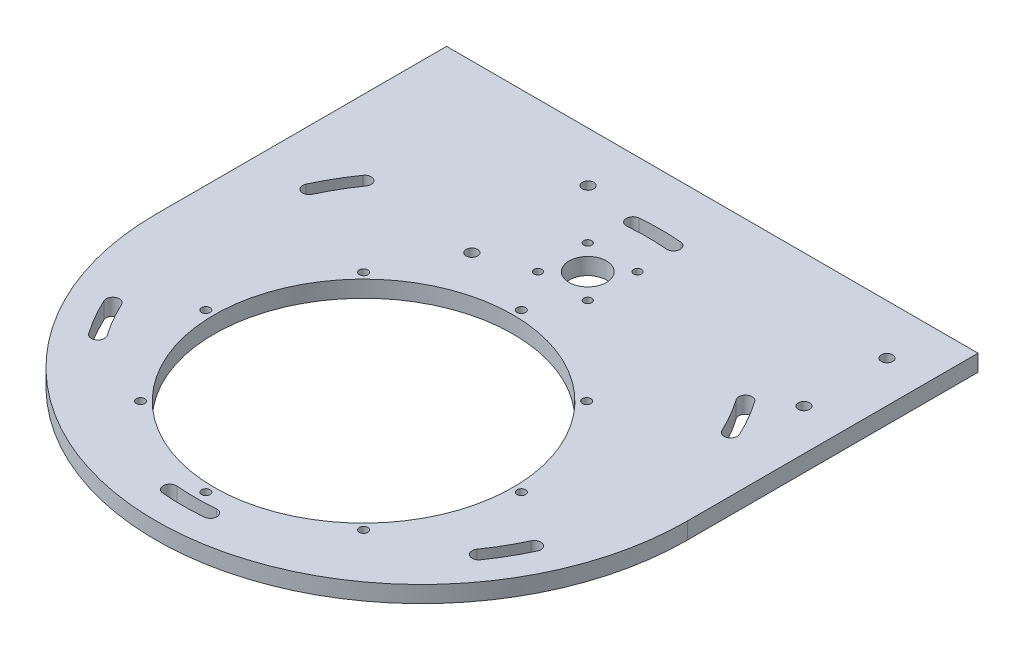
from build123d import *

# Parameters (mm, degrees)
SKETCH1_R                       = 57.15
SKETCH1_R_2                     = 7.14375
EXTRUDE3_DEPTH                  = 6.35
F_4_CLEARANCE_HOLE1_D           = 3.2639
F_4_CLEARANCE_HOLE1_DEPTH       = 9.144
F_4_CLEARANCE_HOLE1_TIP         = 0.980574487
TAP_DRILL_FOR_8_HELICOIL0_D     = 4.3942
TAP_DRILL_FOR_8_HELICOIL0_DEPTH = 9.144
TAP_DRILL_FOR_8_HELICOIL0_TIP   = 1.320150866
EXTRUDE4_REACH                  = 169.765
CIRPATTERN2_COUNT               = 6
TAP_DRILL_FOR_4_HELICOIL1_D     = 3.048
TAP_DRILL_FOR_4_HELICOIL1_DEPTH = 9.144
TAP_DRILL_FOR_4_HELICOIL1_TIP   = 0.915711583
SKETCH14_R                      = 1.63195
CUT_EXTRUDE1_DEPTH              = 168.765029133


with BuildPart() as part:
    # Sketch1 → Extrude3 (new body)
    with BuildSketch(Plane(origin=(0, 0, 0), x_dir=(1, 0, 0), z_dir=(0, 1, 0))):
        with BuildLine():
            Line((-101.6, 133.35), (101.6, 133.35))
            Line((101.6, 133.35), (101.6, 22.225))
            ThreePointArc((101.6, 22.225), (0, -79.375), (-101.6, 22.225))
            Line((-101.6, 22.225), (-101.6, 133.35))
        make_face()
        with Locations(Location((0, 0, 0), (0, 0, 270))):
            Circle(SKETCH1_R, mode=Mode.SUBTRACT)
        with Locations(Location((0, 85.725, 0), (0, 0, 270))):
            Circle(SKETCH1_R_2, mode=Mode.SUBTRACT)
    extrude(amount=-EXTRUDE3_DEPTH)

    # 4 Clearance Hole1
    with Locations(Plane(origin=(-60.325, 0, 0), x_dir=(0, 0, 1), z_dir=(0, 1, 0))):
        with Locations((0, 0), (-42.656216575, 17.668783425), (-60.325, 60.325), (-42.656216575, 102.981216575), (0, 120.65)):
            Hole(F_4_CLEARANCE_HOLE1_D / 2, depth=F_4_CLEARANCE_HOLE1_DEPTH)
            with Locations((0, 0, -(F_4_CLEARANCE_HOLE1_DEPTH + F_4_CLEARANCE_HOLE1_TIP / 2))):  # 118° drill point
                Cone(0, F_4_CLEARANCE_HOLE1_D / 2, F_4_CLEARANCE_HOLE1_TIP, mode=Mode.SUBTRACT)

    # Tap Drill for _8 Helicoil0
    with Locations(Plane(origin=(85.852, 0, -114.3), x_dir=(0, 0, 1), z_dir=(0, 1, 0))):
        with Locations((0, 0), (31.75, 0), (44.45, -114.3), (0, -114.3)):
            Hole(TAP_DRILL_FOR_8_HELICOIL0_D / 2, depth=TAP_DRILL_FOR_8_HELICOIL0_DEPTH)
            with Locations((0, 0, -(TAP_DRILL_FOR_8_HELICOIL0_DEPTH + TAP_DRILL_FOR_8_HELICOIL0_TIP / 2))):  # 118° drill point
                Cone(0, TAP_DRILL_FOR_8_HELICOIL0_D / 2, TAP_DRILL_FOR_8_HELICOIL0_TIP, mode=Mode.SUBTRACT)

    # Sketch12 → Extrude4 (cut, up to next)
    with BuildSketch(Plane(origin=(0, 0, 0), x_dir=(-1, 0, 0), z_dir=(0, 1, 0)), mode=Mode.PRIVATE) as extrude4_sk1:
        with BuildLine():
            ThreePointArc((-7.526769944, -108.256374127), (0, -108.585), (7.526769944, -108.256374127))
            ThreePointArc((7.526769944, -108.256374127), (10.278480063, -110.565333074), (7.969521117, -113.317043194))
            ThreePointArc((7.969521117, -113.317043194), (0, -113.665), (-7.969521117, -113.317043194))
            ThreePointArc((-7.969521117, -113.317043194), (-10.278480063, -110.565333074), (-7.526769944, -108.256374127))
        make_face()
    extrude4_tool1 = extrude(extrude4_sk1.sketch, amount=-EXTRUDE4_REACH, mode=Mode.PRIVATE) & part.part
    extrude4 = extrude4_tool1.solids().sort_by_distance((0, 0, -110.966083))[0]
    add(extrude4, mode=Mode.SUBTRACT)

    # CirPattern2: Extrude4 ×6 about axis
    cirpattern2_axis = Axis((0, 0, -22.225), (0, 1, 0))
    for i in range(1, CIRPATTERN2_COUNT):
        add(extrude4.rotate(cirpattern2_axis, i * 360 / CIRPATTERN2_COUNT), mode=Mode.SUBTRACT)

    # Tap Drill for _4 Helicoil1
    with Locations(Plane(origin=(9.525, 0, -76.2), x_dir=(0, 0, 1), z_dir=(0, 1, 0))):
        with Locations((0, 0), (0, -19.05), (-19.05, 0), (-19.05, -19.05)):
            Hole(TAP_DRILL_FOR_4_HELICOIL1_D / 2, depth=TAP_DRILL_FOR_4_HELICOIL1_DEPTH)
            with Locations((0, 0, -(TAP_DRILL_FOR_4_HELICOIL1_DEPTH + TAP_DRILL_FOR_4_HELICOIL1_TIP / 2))):  # 118° drill point
                Cone(0, TAP_DRILL_FOR_4_HELICOIL1_D / 2, TAP_DRILL_FOR_4_HELICOIL1_TIP, mode=Mode.SUBTRACT)

    # Sketch14 → Cut-Extrude1 (cut, through all)
    with BuildSketch(Plane(origin=(0, 0, 0), x_dir=(1, 0, 0), z_dir=(0, 1, 0))):
        with Locations(Location((-60.325, 0, 0), (0, 0, 270))):
            Circle(SKETCH14_R)
        with Locations(Location((-42.656216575, -42.656216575, 0), (0, 0, 270))):
            Circle(SKETCH14_R)
        with Locations(Location((0, -60.325, 0), (0, 0, 270))):
            Circle(SKETCH14_R)
        with Locations(Location((42.656216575, -42.656216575, 0), (0, 0, 270))):
            Circle(SKETCH14_R)
        with Locations(Location((60.325, 0, 0), (0, 0, 270))):
            Circle(SKETCH14_R)
    extrude(amount=-CUT_EXTRUDE1_DEPTH, mode=Mode.SUBTRACT)


solid = part.part
